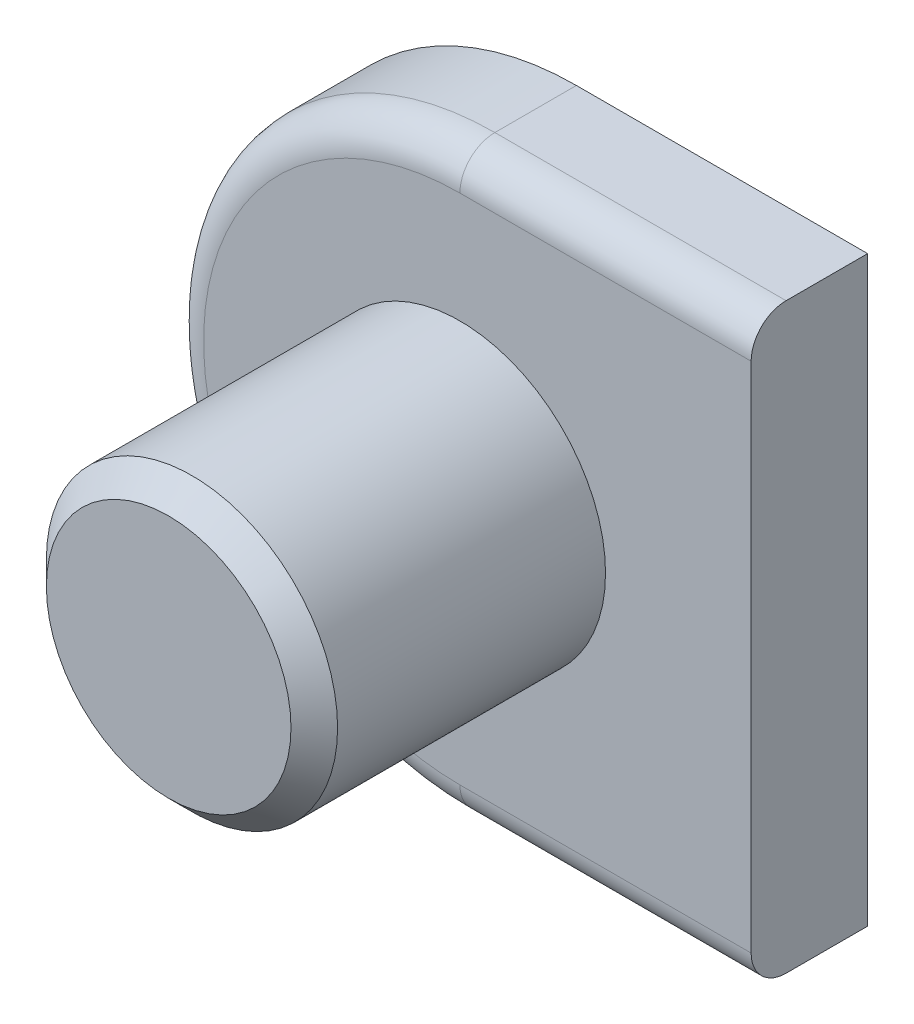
ISO-10303-21;
HEADER;
FILE_DESCRIPTION(('STEP AP214'),'2;1');
FILE_NAME('part.step','',(''),(''),'','','');
FILE_SCHEMA(('AUTOMOTIVE_DESIGN { 1 0 10303 214 1 1 1 1 }'));
ENDSEC;
DATA;
#1=APPLICATION_CONTEXT('core data for automotive mechanical design processes');
#2=APPLICATION_PROTOCOL_DEFINITION('international standard','automotive_design',2000,#1);
#3=PRODUCT_CONTEXT('',#1,'mechanical');
#4=PRODUCT('Part','Part','',(#3));
#5=PRODUCT_RELATED_PRODUCT_CATEGORY('part','',(#4));
#6=PRODUCT_DEFINITION_FORMATION('','',#4);
#7=PRODUCT_DEFINITION_CONTEXT('part definition',#1,'design');
#8=PRODUCT_DEFINITION('design','',#6,#7);
#9=PRODUCT_DEFINITION_SHAPE('','',#8);
#10=(LENGTH_UNIT() NAMED_UNIT(*) SI_UNIT(.MILLI.,.METRE.));
#11=(NAMED_UNIT(*) PLANE_ANGLE_UNIT() SI_UNIT($,.RADIAN.));
#12=(NAMED_UNIT(*) SI_UNIT($,.STERADIAN.) SOLID_ANGLE_UNIT());
#13=UNCERTAINTY_MEASURE_WITH_UNIT(LENGTH_MEASURE(1.E-05),#10,'distance_accuracy_value','');
#14=(GEOMETRIC_REPRESENTATION_CONTEXT(3) GLOBAL_UNCERTAINTY_ASSIGNED_CONTEXT((#13)) GLOBAL_UNIT_ASSIGNED_CONTEXT((#10,
#11,#12)) REPRESENTATION_CONTEXT('',''));
#15=CARTESIAN_POINT('',(0.,0.,0.));
#16=DIRECTION('',(0.,0.,1.));
#17=DIRECTION('',(1.,0.,0.));
#18=AXIS2_PLACEMENT_3D('',#15,#16,#17);
#19=CARTESIAN_POINT('',(-12.5,0.,10.));
#20=DIRECTION('',(0.,0.,-1.));
#21=DIRECTION('',(-1.,0.,0.));
#22=AXIS2_PLACEMENT_3D('',#19,#20,#21);
#23=CYLINDRICAL_SURFACE('',#22,25.);
#24=DIRECTION('',(0.,0.,-1.));
#25=VECTOR('',#24,1.);
#26=CARTESIAN_POINT('',(-12.5,-25.,10.));
#27=LINE('',#26,#25);
#28=CARTESIAN_POINT('',(-12.5,-25.,7.));
#29=VERTEX_POINT('',#28);
#30=CARTESIAN_POINT('',(-12.5,-25.,0.));
#31=VERTEX_POINT('',#30);
#32=EDGE_CURVE('E101',#29,#31,#27,.T.);
#33=ORIENTED_EDGE('',*,*,#32,.F.);
#34=CARTESIAN_POINT('',(-12.5,0.,7.));
#35=DIRECTION('',(0.,0.,1.));
#36=DIRECTION('',(1.,0.,0.));
#37=AXIS2_PLACEMENT_3D('',#34,#35,#36);
#38=CIRCLE('',#37,25.);
#39=CARTESIAN_POINT('',(-12.5,25.,7.));
#40=VERTEX_POINT('',#39);
#41=EDGE_CURVE('E168',#29,#40,#38,.F.);
#42=ORIENTED_EDGE('',*,*,#41,.T.);
#43=DIRECTION('',(0.,0.,-1.));
#44=VECTOR('',#43,1.);
#45=CARTESIAN_POINT('',(-12.5,25.,10.));
#46=LINE('',#45,#44);
#47=CARTESIAN_POINT('',(-12.5,25.,0.));
#48=VERTEX_POINT('',#47);
#49=EDGE_CURVE('E123',#40,#48,#46,.T.);
#50=ORIENTED_EDGE('',*,*,#49,.T.);
#51=CARTESIAN_POINT('',(-12.5,0.,0.));
#52=DIRECTION('',(0.,0.,1.));
#53=DIRECTION('',(1.,0.,0.));
#54=AXIS2_PLACEMENT_3D('',#51,#52,#53);
#55=CIRCLE('',#54,25.);
#56=EDGE_CURVE('E117',#48,#31,#55,.T.);
#57=ORIENTED_EDGE('',*,*,#56,.T.);
#58=EDGE_LOOP('',(#33,#42,#50,#57));
#59=FACE_BOUND('',#58,.T.);
#60=ADVANCED_FACE('F47',(#59),#23,.T.);
#61=CARTESIAN_POINT('',(12.5,-25.,10.));
#62=DIRECTION('',(0.,1.,0.));
#63=DIRECTION('',(-1.,0.,0.));
#64=AXIS2_PLACEMENT_3D('',#61,#62,#63);
#65=PLANE('',#64);
#66=DIRECTION('',(0.,0.,-1.));
#67=VECTOR('',#66,1.);
#68=CARTESIAN_POINT('',(12.5,-25.,10.));
#69=LINE('',#68,#67);
#70=CARTESIAN_POINT('',(12.5,-25.,7.));
#71=VERTEX_POINT('',#70);
#72=CARTESIAN_POINT('',(12.5,-25.,0.));
#73=VERTEX_POINT('',#72);
#74=EDGE_CURVE('E111',#71,#73,#69,.T.);
#75=ORIENTED_EDGE('',*,*,#74,.F.);
#76=DIRECTION('',(1.,0.,0.));
#77=VECTOR('',#76,1.);
#78=CARTESIAN_POINT('',(-12.5,-25.,7.));
#79=LINE('',#78,#77);
#80=EDGE_CURVE('E64',#71,#29,#79,.F.);
#81=ORIENTED_EDGE('',*,*,#80,.T.);
#82=ORIENTED_EDGE('',*,*,#32,.T.);
#83=DIRECTION('',(1.,0.,0.));
#84=VECTOR('',#83,1.);
#85=CARTESIAN_POINT('',(12.5,-25.,0.));
#86=LINE('',#85,#84);
#87=EDGE_CURVE('E104',#31,#73,#86,.T.);
#88=ORIENTED_EDGE('',*,*,#87,.T.);
#89=EDGE_LOOP('',(#75,#81,#82,#88));
#90=FACE_BOUND('',#89,.T.);
#91=ADVANCED_FACE('F103',(#90),#65,.F.);
#92=CARTESIAN_POINT('',(12.5,-25.,10.));
#93=DIRECTION('',(-1.,0.,0.));
#94=DIRECTION('',(0.,0.,1.));
#95=AXIS2_PLACEMENT_3D('',#92,#93,#94);
#96=PLANE('',#95);
#97=DIRECTION('',(0.,0.,-1.));
#98=VECTOR('',#97,1.);
#99=CARTESIAN_POINT('',(12.5,25.,10.));
#100=LINE('',#99,#98);
#101=CARTESIAN_POINT('',(12.5,25.,7.));
#102=VERTEX_POINT('',#101);
#103=CARTESIAN_POINT('',(12.5,25.,0.));
#104=VERTEX_POINT('',#103);
#105=EDGE_CURVE('E143',#102,#104,#100,.T.);
#106=ORIENTED_EDGE('',*,*,#105,.F.);
#107=CARTESIAN_POINT('',(12.5,22.,7.));
#108=DIRECTION('',(-1.,0.,0.));
#109=DIRECTION('',(0.,0.,1.));
#110=AXIS2_PLACEMENT_3D('',#107,#108,#109);
#111=CIRCLE('',#110,3.);
#112=CARTESIAN_POINT('',(12.5,22.,10.));
#113=VERTEX_POINT('',#112);
#114=EDGE_CURVE('E163',#102,#113,#111,.F.);
#115=ORIENTED_EDGE('',*,*,#114,.T.);
#116=DIRECTION('',(0.,1.,0.));
#117=VECTOR('',#116,1.);
#118=CARTESIAN_POINT('',(12.5,-25.,10.));
#119=LINE('',#118,#117);
#120=CARTESIAN_POINT('',(12.5,-22.,10.));
#121=VERTEX_POINT('',#120);
#122=EDGE_CURVE('E133',#121,#113,#119,.T.);
#123=ORIENTED_EDGE('',*,*,#122,.F.);
#124=CARTESIAN_POINT('',(12.5,-22.,7.));
#125=DIRECTION('',(-1.,0.,0.));
#126=DIRECTION('',(0.,0.,1.));
#127=AXIS2_PLACEMENT_3D('',#124,#125,#126);
#128=CIRCLE('',#127,3.);
#129=EDGE_CURVE('E72',#121,#71,#128,.F.);
#130=ORIENTED_EDGE('',*,*,#129,.T.);
#131=ORIENTED_EDGE('',*,*,#74,.T.);
#132=DIRECTION('',(0.,1.,0.));
#133=VECTOR('',#132,1.);
#134=CARTESIAN_POINT('',(12.5,-25.,0.));
#135=LINE('',#134,#133);
#136=EDGE_CURVE('E119',#73,#104,#135,.T.);
#137=ORIENTED_EDGE('',*,*,#136,.T.);
#138=EDGE_LOOP('',(#106,#115,#123,#130,#131,#137));
#139=FACE_BOUND('',#138,.T.);
#140=ADVANCED_FACE('F195',(#139),#96,.F.);
#141=CARTESIAN_POINT('',(12.5,25.,10.));
#142=DIRECTION('',(0.,-1.,0.));
#143=DIRECTION('',(1.,0.,0.));
#144=AXIS2_PLACEMENT_3D('',#141,#142,#143);
#145=PLANE('',#144);
#146=ORIENTED_EDGE('',*,*,#49,.F.);
#147=DIRECTION('',(-1.,0.,0.));
#148=VECTOR('',#147,1.);
#149=CARTESIAN_POINT('',(12.5,25.,7.));
#150=LINE('',#149,#148);
#151=EDGE_CURVE('E158',#40,#102,#150,.F.);
#152=ORIENTED_EDGE('',*,*,#151,.T.);
#153=ORIENTED_EDGE('',*,*,#105,.T.);
#154=DIRECTION('',(-1.,0.,0.));
#155=VECTOR('',#154,1.);
#156=CARTESIAN_POINT('',(12.5,25.,0.));
#157=LINE('',#156,#155);
#158=EDGE_CURVE('E138',#104,#48,#157,.T.);
#159=ORIENTED_EDGE('',*,*,#158,.T.);
#160=EDGE_LOOP('',(#146,#152,#153,#159));
#161=FACE_BOUND('',#160,.T.);
#162=ADVANCED_FACE('F215',(#161),#145,.F.);
#163=CARTESIAN_POINT('',(-12.5,0.,10.));
#164=DIRECTION('',(0.,0.,1.));
#165=DIRECTION('',(1.,0.,0.));
#166=AXIS2_PLACEMENT_3D('',#163,#164,#165);
#167=PLANE('',#166);
#168=ORIENTED_EDGE('',*,*,#122,.T.);
#169=DIRECTION('',(-1.,0.,0.));
#170=VECTOR('',#169,1.);
#171=CARTESIAN_POINT('',(-12.5,22.,10.));
#172=LINE('',#171,#170);
#173=CARTESIAN_POINT('',(-12.5,22.,10.));
#174=VERTEX_POINT('',#173);
#175=EDGE_CURVE('E154',#113,#174,#172,.T.);
#176=ORIENTED_EDGE('',*,*,#175,.T.);
#177=CARTESIAN_POINT('',(-12.5,0.,10.));
#178=DIRECTION('',(0.,0.,1.));
#179=DIRECTION('',(1.,0.,0.));
#180=AXIS2_PLACEMENT_3D('',#177,#178,#179);
#181=CIRCLE('',#180,22.);
#182=CARTESIAN_POINT('',(-12.5,-22.,10.));
#183=VERTEX_POINT('',#182);
#184=EDGE_CURVE('E148',#174,#183,#181,.T.);
#185=ORIENTED_EDGE('',*,*,#184,.T.);
#186=DIRECTION('',(1.,0.,0.));
#187=VECTOR('',#186,1.);
#188=CARTESIAN_POINT('',(12.5,-22.,10.));
#189=LINE('',#188,#187);
#190=EDGE_CURVE('E151',#183,#121,#189,.T.);
#191=ORIENTED_EDGE('',*,*,#190,.T.);
#192=EDGE_LOOP('',(#168,#176,#185,#191));
#193=FACE_BOUND('',#192,.T.);
#194=CARTESIAN_POINT('',(-12.5,0.,10.));
#195=DIRECTION('',(0.,0.,1.));
#196=DIRECTION('',(1.,0.,0.));
#197=AXIS2_PLACEMENT_3D('',#194,#195,#196);
#198=CIRCLE('',#197,12.5);
#199=CARTESIAN_POINT('',(0.,0.,10.));
#200=VERTEX_POINT('',#199);
#201=EDGE_CURVE('E110',#200,#200,#198,.T.);
#202=ORIENTED_EDGE('',*,*,#201,.F.);
#203=EDGE_LOOP('',(#202));
#204=FACE_BOUND('',#203,.T.);
#205=ADVANCED_FACE('F221',(#193,#204),#167,.T.);
#206=CARTESIAN_POINT('',(-12.5,0.,0.));
#207=DIRECTION('',(0.,0.,1.));
#208=DIRECTION('',(1.,0.,0.));
#209=AXIS2_PLACEMENT_3D('',#206,#207,#208);
#210=PLANE('',#209);
#211=ORIENTED_EDGE('',*,*,#56,.F.);
#212=ORIENTED_EDGE('',*,*,#158,.F.);
#213=ORIENTED_EDGE('',*,*,#136,.F.);
#214=ORIENTED_EDGE('',*,*,#87,.F.);
#215=EDGE_LOOP('',(#211,#212,#213,#214));
#216=FACE_BOUND('',#215,.T.);
#217=ADVANCED_FACE('F115',(#216),#210,.F.);
#218=CARTESIAN_POINT('',(-12.5,0.,35.));
#219=DIRECTION('',(0.,0.,-1.));
#220=DIRECTION('',(-1.,0.,0.));
#221=AXIS2_PLACEMENT_3D('',#218,#219,#220);
#222=CYLINDRICAL_SURFACE('',#221,12.5);
#223=CARTESIAN_POINT('',(-12.5,0.,33.));
#224=DIRECTION('',(0.,0.,1.));
#225=DIRECTION('',(1.,0.,0.));
#226=AXIS2_PLACEMENT_3D('',#223,#224,#225);
#227=CIRCLE('',#226,12.5);
#228=CARTESIAN_POINT('',(0.,0.,33.));
#229=VERTEX_POINT('',#228);
#230=EDGE_CURVE('E11',#229,#229,#227,.F.);
#231=ORIENTED_EDGE('',*,*,#230,.T.);
#232=EDGE_LOOP('',(#231));
#233=FACE_BOUND('',#232,.T.);
#234=ORIENTED_EDGE('',*,*,#201,.T.);
#235=EDGE_LOOP('',(#234));
#236=FACE_BOUND('',#235,.T.);
#237=ADVANCED_FACE('F207',(#233,#236),#222,.T.);
#238=CARTESIAN_POINT('',(-12.5,0.,35.));
#239=DIRECTION('',(0.,0.,1.));
#240=DIRECTION('',(1.,0.,0.));
#241=AXIS2_PLACEMENT_3D('',#238,#239,#240);
#242=PLANE('',#241);
#243=CARTESIAN_POINT('',(-12.5,0.,35.));
#244=DIRECTION('',(0.,0.,1.));
#245=DIRECTION('',(1.,0.,0.));
#246=AXIS2_PLACEMENT_3D('',#243,#244,#245);
#247=CIRCLE('',#246,10.5);
#248=CARTESIAN_POINT('',(-2.00000000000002,0.,35.));
#249=VERTEX_POINT('',#248);
#250=EDGE_CURVE('E57',#249,#249,#247,.T.);
#251=ORIENTED_EDGE('',*,*,#250,.T.);
#252=EDGE_LOOP('',(#251));
#253=FACE_BOUND('',#252,.T.);
#254=ADVANCED_FACE('F176',(#253),#242,.T.);
#255=CARTESIAN_POINT('',(-12.5,-22.,7.));
#256=DIRECTION('',(-1.,0.,0.));
#257=DIRECTION('',(0.,-1.,0.));
#258=AXIS2_PLACEMENT_3D('',#255,#256,#257);
#259=CYLINDRICAL_SURFACE('',#258,3.);
#260=ORIENTED_EDGE('',*,*,#129,.F.);
#261=ORIENTED_EDGE('',*,*,#190,.F.);
#262=CARTESIAN_POINT('',(-12.5,-22.,7.));
#263=DIRECTION('',(-1.,0.,0.));
#264=DIRECTION('',(0.,0.,1.));
#265=AXIS2_PLACEMENT_3D('',#262,#263,#264);
#266=CIRCLE('',#265,3.);
#267=EDGE_CURVE('E126',#29,#183,#266,.T.);
#268=ORIENTED_EDGE('',*,*,#267,.F.);
#269=ORIENTED_EDGE('',*,*,#80,.F.);
#270=EDGE_LOOP('',(#260,#261,#268,#269));
#271=FACE_BOUND('',#270,.T.);
#272=ADVANCED_FACE('F200',(#271),#259,.T.);
#273=CARTESIAN_POINT('',(-12.5,0.,7.));
#274=DIRECTION('',(0.,0.,1.));
#275=DIRECTION('',(1.,0.,0.));
#276=AXIS2_PLACEMENT_3D('',#273,#274,#275);
#277=TOROIDAL_SURFACE('',#276,22.,3.);
#278=ORIENTED_EDGE('',*,*,#267,.T.);
#279=ORIENTED_EDGE('',*,*,#184,.F.);
#280=CARTESIAN_POINT('',(-12.5,22.,7.));
#281=DIRECTION('',(1.,0.,0.));
#282=DIRECTION('',(0.,0.,-1.));
#283=AXIS2_PLACEMENT_3D('',#280,#281,#282);
#284=CIRCLE('',#283,3.);
#285=EDGE_CURVE('E130',#40,#174,#284,.T.);
#286=ORIENTED_EDGE('',*,*,#285,.F.);
#287=ORIENTED_EDGE('',*,*,#41,.F.);
#288=EDGE_LOOP('',(#278,#279,#286,#287));
#289=FACE_BOUND('',#288,.T.);
#290=ADVANCED_FACE('F185',(#289),#277,.T.);
#291=CARTESIAN_POINT('',(-12.5,22.,7.));
#292=DIRECTION('',(1.,0.,0.));
#293=DIRECTION('',(0.,1.,0.));
#294=AXIS2_PLACEMENT_3D('',#291,#292,#293);
#295=CYLINDRICAL_SURFACE('',#294,3.);
#296=ORIENTED_EDGE('',*,*,#114,.F.);
#297=ORIENTED_EDGE('',*,*,#151,.F.);
#298=ORIENTED_EDGE('',*,*,#285,.T.);
#299=ORIENTED_EDGE('',*,*,#175,.F.);
#300=EDGE_LOOP('',(#296,#297,#298,#299));
#301=FACE_BOUND('',#300,.T.);
#302=ADVANCED_FACE('F179',(#301),#295,.T.);
#303=CARTESIAN_POINT('',(-12.5,0.,35.));
#304=DIRECTION('',(0.,0.,-1.));
#305=DIRECTION('',(-1.,0.,0.));
#306=AXIS2_PLACEMENT_3D('',#303,#304,#305);
#307=CONICAL_SURFACE('',#306,10.5,0.785398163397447);
#308=ORIENTED_EDGE('',*,*,#230,.F.);
#309=EDGE_LOOP('',(#308));
#310=FACE_BOUND('',#309,.T.);
#311=ORIENTED_EDGE('',*,*,#250,.F.);
#312=EDGE_LOOP('',(#311));
#313=FACE_BOUND('',#312,.T.);
#314=ADVANCED_FACE('F50',(#310,#313),#307,.T.);
#315=CLOSED_SHELL('',(#60,#91,#140,#162,#205,#217,#237,#254,#272,#290,#302,#314));
#316=MANIFOLD_SOLID_BREP('B2',#315);
#317=ADVANCED_BREP_SHAPE_REPRESENTATION('',(#18,#316),#14);
#318=SHAPE_DEFINITION_REPRESENTATION(#9,#317);
ENDSEC;
END-ISO-10303-21;
